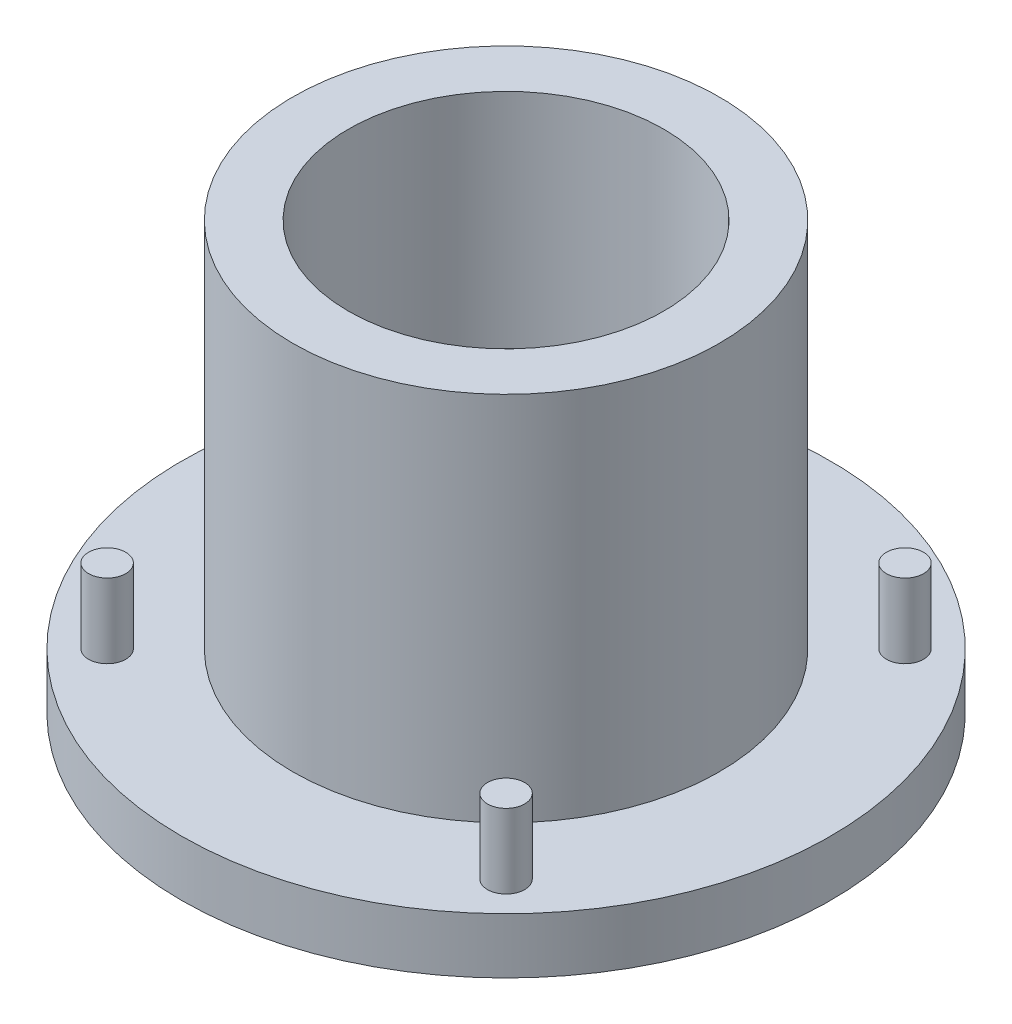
ISO-10303-21;
HEADER;
FILE_DESCRIPTION(('STEP AP214'),'2;1');
FILE_NAME('part.step','',(''),(''),'','','');
FILE_SCHEMA(('AUTOMOTIVE_DESIGN { 1 0 10303 214 1 1 1 1 }'));
ENDSEC;
DATA;
#1=APPLICATION_CONTEXT('core data for automotive mechanical design processes');
#2=APPLICATION_PROTOCOL_DEFINITION('international standard','automotive_design',2000,#1);
#3=PRODUCT_CONTEXT('',#1,'mechanical');
#4=PRODUCT('Part','Part','',(#3));
#5=PRODUCT_RELATED_PRODUCT_CATEGORY('part','',(#4));
#6=PRODUCT_DEFINITION_FORMATION('','',#4);
#7=PRODUCT_DEFINITION_CONTEXT('part definition',#1,'design');
#8=PRODUCT_DEFINITION('design','',#6,#7);
#9=PRODUCT_DEFINITION_SHAPE('','',#8);
#10=(LENGTH_UNIT() NAMED_UNIT(*) SI_UNIT(.MILLI.,.METRE.));
#11=(NAMED_UNIT(*) PLANE_ANGLE_UNIT() SI_UNIT($,.RADIAN.));
#12=(NAMED_UNIT(*) SI_UNIT($,.STERADIAN.) SOLID_ANGLE_UNIT());
#13=UNCERTAINTY_MEASURE_WITH_UNIT(LENGTH_MEASURE(1.E-05),#10,'distance_accuracy_value','');
#14=(GEOMETRIC_REPRESENTATION_CONTEXT(3) GLOBAL_UNCERTAINTY_ASSIGNED_CONTEXT((#13)) GLOBAL_UNIT_ASSIGNED_CONTEXT((#10,
#11,#12)) REPRESENTATION_CONTEXT('',''));
#15=CARTESIAN_POINT('',(0.,0.,0.));
#16=DIRECTION('',(0.,0.,1.));
#17=DIRECTION('',(1.,0.,0.));
#18=AXIS2_PLACEMENT_3D('',#15,#16,#17);
#19=CARTESIAN_POINT('',(0.,0.,0.));
#20=DIRECTION('',(0.,1.,0.));
#21=DIRECTION('',(0.,0.,1.));
#22=AXIS2_PLACEMENT_3D('',#19,#20,#21);
#23=PLANE('',#22);
#24=CARTESIAN_POINT('',(10.75,0.,-10.75));
#25=DIRECTION('',(0.,1.,0.));
#26=DIRECTION('',(0.,0.,1.));
#27=AXIS2_PLACEMENT_3D('',#24,#25,#26);
#28=CIRCLE('',#27,1.);
#29=CARTESIAN_POINT('',(10.75,0.,-9.75));
#30=VERTEX_POINT('',#29);
#31=EDGE_CURVE('E61',#30,#30,#28,.T.);
#32=ORIENTED_EDGE('',*,*,#31,.F.);
#33=EDGE_LOOP('',(#32));
#34=FACE_BOUND('',#33,.T.);
#35=CARTESIAN_POINT('',(-10.75,0.,10.75));
#36=DIRECTION('',(0.,1.,0.));
#37=DIRECTION('',(0.,0.,1.));
#38=AXIS2_PLACEMENT_3D('',#35,#36,#37);
#39=CIRCLE('',#38,1.);
#40=CARTESIAN_POINT('',(-10.75,0.,11.75));
#41=VERTEX_POINT('',#40);
#42=EDGE_CURVE('E49',#41,#41,#39,.T.);
#43=ORIENTED_EDGE('',*,*,#42,.F.);
#44=EDGE_LOOP('',(#43));
#45=FACE_BOUND('',#44,.T.);
#46=CARTESIAN_POINT('',(0.,0.,0.));
#47=DIRECTION('',(0.,1.,0.));
#48=DIRECTION('',(0.,0.,1.));
#49=AXIS2_PLACEMENT_3D('',#46,#47,#48);
#50=CIRCLE('',#49,17.5);
#51=CARTESIAN_POINT('',(0.,0.,17.5));
#52=VERTEX_POINT('',#51);
#53=EDGE_CURVE('E42',#52,#52,#50,.T.);
#54=ORIENTED_EDGE('',*,*,#53,.T.);
#55=EDGE_LOOP('',(#54));
#56=FACE_BOUND('',#55,.T.);
#57=CARTESIAN_POINT('',(-10.75,0.,-10.75));
#58=DIRECTION('',(0.,1.,0.));
#59=DIRECTION('',(0.,0.,1.));
#60=AXIS2_PLACEMENT_3D('',#57,#58,#59);
#61=CIRCLE('',#60,1.);
#62=CARTESIAN_POINT('',(-10.75,0.,-9.74999999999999));
#63=VERTEX_POINT('',#62);
#64=EDGE_CURVE('E55',#63,#63,#61,.T.);
#65=ORIENTED_EDGE('',*,*,#64,.F.);
#66=EDGE_LOOP('',(#65));
#67=FACE_BOUND('',#66,.T.);
#68=CARTESIAN_POINT('',(10.75,0.,10.75));
#69=DIRECTION('',(0.,1.,0.));
#70=DIRECTION('',(0.,0.,1.));
#71=AXIS2_PLACEMENT_3D('',#68,#69,#70);
#72=CIRCLE('',#71,0.999999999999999);
#73=CARTESIAN_POINT('',(10.75,0.,11.75));
#74=VERTEX_POINT('',#73);
#75=EDGE_CURVE('E67',#74,#74,#72,.T.);
#76=ORIENTED_EDGE('',*,*,#75,.F.);
#77=EDGE_LOOP('',(#76));
#78=FACE_BOUND('',#77,.T.);
#79=CARTESIAN_POINT('',(0.,0.,0.));
#80=DIRECTION('',(0.,1.,0.));
#81=DIRECTION('',(0.,0.,1.));
#82=AXIS2_PLACEMENT_3D('',#79,#80,#81);
#83=CIRCLE('',#82,11.5);
#84=CARTESIAN_POINT('',(0.,0.,11.5));
#85=VERTEX_POINT('',#84);
#86=EDGE_CURVE('E73',#85,#85,#83,.T.);
#87=ORIENTED_EDGE('',*,*,#86,.F.);
#88=EDGE_LOOP('',(#87));
#89=FACE_BOUND('',#88,.T.);
#90=ADVANCED_FACE('F31',(#34,#45,#56,#67,#78,#89),#23,.T.);
#91=CARTESIAN_POINT('',(0.,-3.,0.));
#92=DIRECTION('',(0.,1.,0.));
#93=DIRECTION('',(0.,0.,1.));
#94=AXIS2_PLACEMENT_3D('',#91,#92,#93);
#95=CYLINDRICAL_SURFACE('',#94,17.5);
#96=CARTESIAN_POINT('',(0.,-3.,0.));
#97=DIRECTION('',(0.,1.,0.));
#98=DIRECTION('',(0.,0.,1.));
#99=AXIS2_PLACEMENT_3D('',#96,#97,#98);
#100=CIRCLE('',#99,17.5);
#101=CARTESIAN_POINT('',(0.,-3.,17.5));
#102=VERTEX_POINT('',#101);
#103=EDGE_CURVE('E38',#102,#102,#100,.T.);
#104=ORIENTED_EDGE('',*,*,#103,.T.);
#105=EDGE_LOOP('',(#104));
#106=FACE_BOUND('',#105,.T.);
#107=ORIENTED_EDGE('',*,*,#53,.F.);
#108=EDGE_LOOP('',(#107));
#109=FACE_BOUND('',#108,.T.);
#110=ADVANCED_FACE('F33',(#106,#109),#95,.T.);
#111=CARTESIAN_POINT('',(0.,-3.,0.));
#112=DIRECTION('',(0.,1.,0.));
#113=DIRECTION('',(0.,0.,1.));
#114=AXIS2_PLACEMENT_3D('',#111,#112,#113);
#115=PLANE('',#114);
#116=CARTESIAN_POINT('',(0.,-3.,0.));
#117=DIRECTION('',(0.,1.,0.));
#118=DIRECTION('',(0.,0.,1.));
#119=AXIS2_PLACEMENT_3D('',#116,#117,#118);
#120=CIRCLE('',#119,2.25);
#121=CARTESIAN_POINT('',(0.,-3.,2.25));
#122=VERTEX_POINT('',#121);
#123=EDGE_CURVE('E81',#122,#122,#120,.T.);
#124=ORIENTED_EDGE('',*,*,#123,.T.);
#125=EDGE_LOOP('',(#124));
#126=FACE_BOUND('',#125,.T.);
#127=ORIENTED_EDGE('',*,*,#103,.F.);
#128=EDGE_LOOP('',(#127));
#129=FACE_BOUND('',#128,.T.);
#130=ADVANCED_FACE('F88',(#126,#129),#115,.F.);
#131=CARTESIAN_POINT('',(-10.75,4.,10.75));
#132=DIRECTION('',(0.,-1.,0.));
#133=DIRECTION('',(0.,0.,-1.));
#134=AXIS2_PLACEMENT_3D('',#131,#132,#133);
#135=CYLINDRICAL_SURFACE('',#134,1.);
#136=CARTESIAN_POINT('',(-10.75,4.,10.75));
#137=DIRECTION('',(0.,1.,0.));
#138=DIRECTION('',(0.,0.,1.));
#139=AXIS2_PLACEMENT_3D('',#136,#137,#138);
#140=CIRCLE('',#139,1.);
#141=CARTESIAN_POINT('',(-10.75,4.,11.75));
#142=VERTEX_POINT('',#141);
#143=EDGE_CURVE('E47',#142,#142,#140,.T.);
#144=ORIENTED_EDGE('',*,*,#143,.F.);
#145=EDGE_LOOP('',(#144));
#146=FACE_BOUND('',#145,.T.);
#147=ORIENTED_EDGE('',*,*,#42,.T.);
#148=EDGE_LOOP('',(#147));
#149=FACE_BOUND('',#148,.T.);
#150=ADVANCED_FACE('F117',(#146,#149),#135,.T.);
#151=CARTESIAN_POINT('',(-10.75,4.,10.75));
#152=DIRECTION('',(0.,1.,0.));
#153=DIRECTION('',(0.,0.,1.));
#154=AXIS2_PLACEMENT_3D('',#151,#152,#153);
#155=PLANE('',#154);
#156=ORIENTED_EDGE('',*,*,#143,.T.);
#157=EDGE_LOOP('',(#156));
#158=FACE_BOUND('',#157,.T.);
#159=ADVANCED_FACE('F120',(#158),#155,.T.);
#160=CARTESIAN_POINT('',(-10.75,4.,-10.75));
#161=DIRECTION('',(0.,-1.,0.));
#162=DIRECTION('',(0.,0.,-1.));
#163=AXIS2_PLACEMENT_3D('',#160,#161,#162);
#164=CYLINDRICAL_SURFACE('',#163,1.);
#165=CARTESIAN_POINT('',(-10.75,4.,-10.75));
#166=DIRECTION('',(0.,1.,0.));
#167=DIRECTION('',(0.,0.,1.));
#168=AXIS2_PLACEMENT_3D('',#165,#166,#167);
#169=CIRCLE('',#168,1.);
#170=CARTESIAN_POINT('',(-10.75,4.,-9.74999999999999));
#171=VERTEX_POINT('',#170);
#172=EDGE_CURVE('E52',#171,#171,#169,.T.);
#173=ORIENTED_EDGE('',*,*,#172,.F.);
#174=EDGE_LOOP('',(#173));
#175=FACE_BOUND('',#174,.T.);
#176=ORIENTED_EDGE('',*,*,#64,.T.);
#177=EDGE_LOOP('',(#176));
#178=FACE_BOUND('',#177,.T.);
#179=ADVANCED_FACE('F124',(#175,#178),#164,.T.);
#180=CARTESIAN_POINT('',(-10.75,4.,-10.75));
#181=DIRECTION('',(0.,1.,0.));
#182=DIRECTION('',(0.,0.,1.));
#183=AXIS2_PLACEMENT_3D('',#180,#181,#182);
#184=PLANE('',#183);
#185=ORIENTED_EDGE('',*,*,#172,.T.);
#186=EDGE_LOOP('',(#185));
#187=FACE_BOUND('',#186,.T.);
#188=ADVANCED_FACE('F128',(#187),#184,.T.);
#189=CARTESIAN_POINT('',(10.75,4.,-10.75));
#190=DIRECTION('',(0.,-1.,0.));
#191=DIRECTION('',(0.,0.,-1.));
#192=AXIS2_PLACEMENT_3D('',#189,#190,#191);
#193=CYLINDRICAL_SURFACE('',#192,1.);
#194=CARTESIAN_POINT('',(10.75,4.,-10.75));
#195=DIRECTION('',(0.,1.,0.));
#196=DIRECTION('',(0.,0.,1.));
#197=AXIS2_PLACEMENT_3D('',#194,#195,#196);
#198=CIRCLE('',#197,1.);
#199=CARTESIAN_POINT('',(10.75,4.,-9.75));
#200=VERTEX_POINT('',#199);
#201=EDGE_CURVE('E58',#200,#200,#198,.T.);
#202=ORIENTED_EDGE('',*,*,#201,.F.);
#203=EDGE_LOOP('',(#202));
#204=FACE_BOUND('',#203,.T.);
#205=ORIENTED_EDGE('',*,*,#31,.T.);
#206=EDGE_LOOP('',(#205));
#207=FACE_BOUND('',#206,.T.);
#208=ADVANCED_FACE('F132',(#204,#207),#193,.T.);
#209=CARTESIAN_POINT('',(10.75,4.,-10.75));
#210=DIRECTION('',(0.,1.,0.));
#211=DIRECTION('',(0.,0.,1.));
#212=AXIS2_PLACEMENT_3D('',#209,#210,#211);
#213=PLANE('',#212);
#214=ORIENTED_EDGE('',*,*,#201,.T.);
#215=EDGE_LOOP('',(#214));
#216=FACE_BOUND('',#215,.T.);
#217=ADVANCED_FACE('F136',(#216),#213,.T.);
#218=CARTESIAN_POINT('',(10.75,4.,10.75));
#219=DIRECTION('',(0.,-1.,0.));
#220=DIRECTION('',(0.,0.,-1.));
#221=AXIS2_PLACEMENT_3D('',#218,#219,#220);
#222=CYLINDRICAL_SURFACE('',#221,0.999999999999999);
#223=CARTESIAN_POINT('',(10.75,4.,10.75));
#224=DIRECTION('',(0.,1.,0.));
#225=DIRECTION('',(0.,0.,1.));
#226=AXIS2_PLACEMENT_3D('',#223,#224,#225);
#227=CIRCLE('',#226,0.999999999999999);
#228=CARTESIAN_POINT('',(10.75,4.,11.75));
#229=VERTEX_POINT('',#228);
#230=EDGE_CURVE('E64',#229,#229,#227,.T.);
#231=ORIENTED_EDGE('',*,*,#230,.F.);
#232=EDGE_LOOP('',(#231));
#233=FACE_BOUND('',#232,.T.);
#234=ORIENTED_EDGE('',*,*,#75,.T.);
#235=EDGE_LOOP('',(#234));
#236=FACE_BOUND('',#235,.T.);
#237=ADVANCED_FACE('F140',(#233,#236),#222,.T.);
#238=CARTESIAN_POINT('',(10.75,4.,10.75));
#239=DIRECTION('',(0.,1.,0.));
#240=DIRECTION('',(0.,0.,1.));
#241=AXIS2_PLACEMENT_3D('',#238,#239,#240);
#242=PLANE('',#241);
#243=ORIENTED_EDGE('',*,*,#230,.T.);
#244=EDGE_LOOP('',(#243));
#245=FACE_BOUND('',#244,.T.);
#246=ADVANCED_FACE('F144',(#245),#242,.T.);
#247=CARTESIAN_POINT('',(0.,20.,0.));
#248=DIRECTION('',(0.,1.,0.));
#249=DIRECTION('',(0.,0.,1.));
#250=AXIS2_PLACEMENT_3D('',#247,#248,#249);
#251=PLANE('',#250);
#252=CARTESIAN_POINT('',(0.,20.,0.));
#253=DIRECTION('',(0.,1.,0.));
#254=DIRECTION('',(0.,0.,1.));
#255=AXIS2_PLACEMENT_3D('',#252,#253,#254);
#256=CIRCLE('',#255,11.5);
#257=CARTESIAN_POINT('',(0.,20.,11.5));
#258=VERTEX_POINT('',#257);
#259=EDGE_CURVE('E70',#258,#258,#256,.T.);
#260=ORIENTED_EDGE('',*,*,#259,.T.);
#261=EDGE_LOOP('',(#260));
#262=FACE_BOUND('',#261,.T.);
#263=CARTESIAN_POINT('',(0.,20.,0.));
#264=DIRECTION('',(0.,1.,0.));
#265=DIRECTION('',(0.,0.,1.));
#266=AXIS2_PLACEMENT_3D('',#263,#264,#265);
#267=CIRCLE('',#266,8.5);
#268=CARTESIAN_POINT('',(0.,20.,8.5));
#269=VERTEX_POINT('',#268);
#270=EDGE_CURVE('E76',#269,#269,#267,.T.);
#271=ORIENTED_EDGE('',*,*,#270,.F.);
#272=EDGE_LOOP('',(#271));
#273=FACE_BOUND('',#272,.T.);
#274=ADVANCED_FACE('F148',(#262,#273),#251,.T.);
#275=CARTESIAN_POINT('',(0.,20.,0.));
#276=DIRECTION('',(0.,-1.,0.));
#277=DIRECTION('',(0.,0.,-1.));
#278=AXIS2_PLACEMENT_3D('',#275,#276,#277);
#279=CYLINDRICAL_SURFACE('',#278,11.5);
#280=ORIENTED_EDGE('',*,*,#259,.F.);
#281=EDGE_LOOP('',(#280));
#282=FACE_BOUND('',#281,.T.);
#283=ORIENTED_EDGE('',*,*,#86,.T.);
#284=EDGE_LOOP('',(#283));
#285=FACE_BOUND('',#284,.T.);
#286=ADVANCED_FACE('F104',(#282,#285),#279,.T.);
#287=CARTESIAN_POINT('',(0.,20.,0.));
#288=DIRECTION('',(0.,-1.,0.));
#289=DIRECTION('',(0.,0.,-1.));
#290=AXIS2_PLACEMENT_3D('',#287,#288,#289);
#291=CYLINDRICAL_SURFACE('',#290,8.5);
#292=CARTESIAN_POINT('',(0.,8.,0.));
#293=DIRECTION('',(0.,1.,0.));
#294=DIRECTION('',(0.,0.,1.));
#295=AXIS2_PLACEMENT_3D('',#292,#293,#294);
#296=CIRCLE('',#295,8.5);
#297=CARTESIAN_POINT('',(0.,8.,8.5));
#298=VERTEX_POINT('',#297);
#299=EDGE_CURVE('E10',#298,#298,#296,.T.);
#300=ORIENTED_EDGE('',*,*,#299,.F.);
#301=EDGE_LOOP('',(#300));
#302=FACE_BOUND('',#301,.T.);
#303=ORIENTED_EDGE('',*,*,#270,.T.);
#304=EDGE_LOOP('',(#303));
#305=FACE_BOUND('',#304,.T.);
#306=ADVANCED_FACE('F99',(#302,#305),#291,.F.);
#307=CARTESIAN_POINT('',(0.,8.,0.));
#308=DIRECTION('',(0.,1.,0.));
#309=DIRECTION('',(0.,0.,1.));
#310=AXIS2_PLACEMENT_3D('',#307,#308,#309);
#311=PLANE('',#310);
#312=CARTESIAN_POINT('',(0.,8.,0.));
#313=DIRECTION('',(0.,1.,0.));
#314=DIRECTION('',(0.,0.,1.));
#315=AXIS2_PLACEMENT_3D('',#312,#313,#314);
#316=CIRCLE('',#315,2.25);
#317=CARTESIAN_POINT('',(0.,8.,2.25));
#318=VERTEX_POINT('',#317);
#319=EDGE_CURVE('E82',#318,#318,#316,.T.);
#320=ORIENTED_EDGE('',*,*,#319,.F.);
#321=EDGE_LOOP('',(#320));
#322=FACE_BOUND('',#321,.T.);
#323=ORIENTED_EDGE('',*,*,#299,.T.);
#324=EDGE_LOOP('',(#323));
#325=FACE_BOUND('',#324,.T.);
#326=ADVANCED_FACE('F94',(#322,#325),#311,.T.);
#327=CARTESIAN_POINT('',(0.,-3.,0.));
#328=DIRECTION('',(0.,1.,0.));
#329=DIRECTION('',(0.,0.,1.));
#330=AXIS2_PLACEMENT_3D('',#327,#328,#329);
#331=CYLINDRICAL_SURFACE('',#330,2.25);
#332=ORIENTED_EDGE('',*,*,#123,.F.);
#333=EDGE_LOOP('',(#332));
#334=FACE_BOUND('',#333,.T.);
#335=ORIENTED_EDGE('',*,*,#319,.T.);
#336=EDGE_LOOP('',(#335));
#337=FACE_BOUND('',#336,.T.);
#338=ADVANCED_FACE('F91',(#334,#337),#331,.F.);
#339=CLOSED_SHELL('',(#90,#110,#130,#150,#159,#179,#188,#208,#217,#237,#246,#274,#286,#306,#326,#338));
#340=MANIFOLD_SOLID_BREP('B2',#339);
#341=ADVANCED_BREP_SHAPE_REPRESENTATION('',(#18,#340),#14);
#342=SHAPE_DEFINITION_REPRESENTATION(#9,#341);
ENDSEC;
END-ISO-10303-21;
